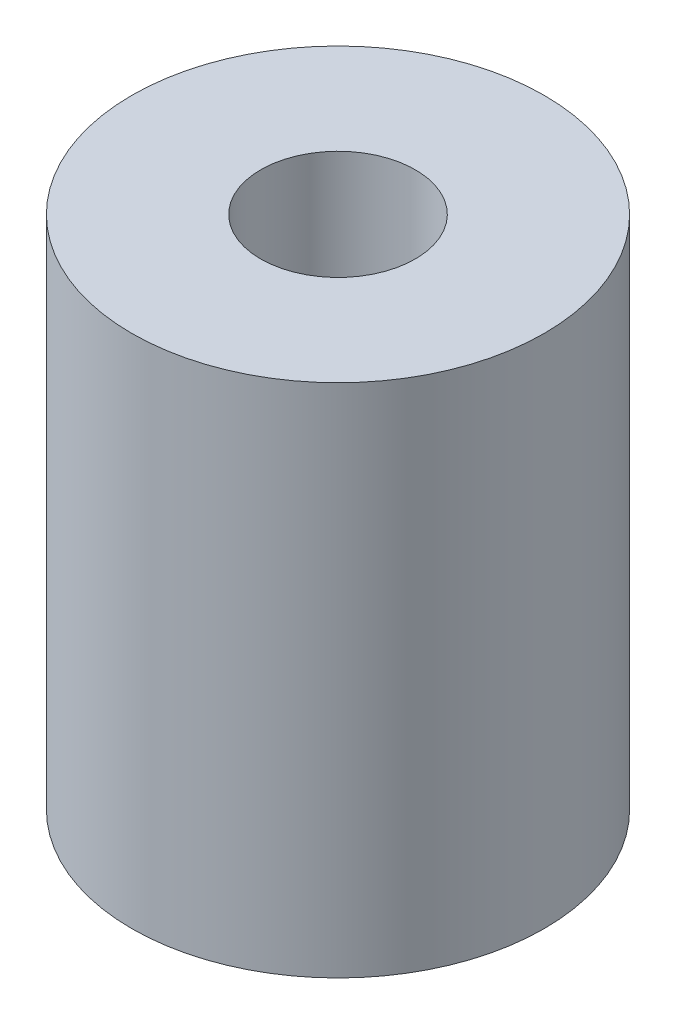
ISO-10303-21;
HEADER;
FILE_DESCRIPTION(('STEP AP214'),'2;1');
FILE_NAME('part.step','',(''),(''),'','','');
FILE_SCHEMA(('AUTOMOTIVE_DESIGN { 1 0 10303 214 1 1 1 1 }'));
ENDSEC;
DATA;
#1=APPLICATION_CONTEXT('core data for automotive mechanical design processes');
#2=APPLICATION_PROTOCOL_DEFINITION('international standard','automotive_design',2000,#1);
#3=PRODUCT_CONTEXT('',#1,'mechanical');
#4=PRODUCT('Part','Part','',(#3));
#5=PRODUCT_RELATED_PRODUCT_CATEGORY('part','',(#4));
#6=PRODUCT_DEFINITION_FORMATION('','',#4);
#7=PRODUCT_DEFINITION_CONTEXT('part definition',#1,'design');
#8=PRODUCT_DEFINITION('design','',#6,#7);
#9=PRODUCT_DEFINITION_SHAPE('','',#8);
#10=(LENGTH_UNIT() NAMED_UNIT(*) SI_UNIT(.MILLI.,.METRE.));
#11=(NAMED_UNIT(*) PLANE_ANGLE_UNIT() SI_UNIT($,.RADIAN.));
#12=(NAMED_UNIT(*) SI_UNIT($,.STERADIAN.) SOLID_ANGLE_UNIT());
#13=UNCERTAINTY_MEASURE_WITH_UNIT(LENGTH_MEASURE(1.E-05),#10,'distance_accuracy_value','');
#14=(GEOMETRIC_REPRESENTATION_CONTEXT(3) GLOBAL_UNCERTAINTY_ASSIGNED_CONTEXT((#13)) GLOBAL_UNIT_ASSIGNED_CONTEXT((#10,
#11,#12)) REPRESENTATION_CONTEXT('',''));
#15=CARTESIAN_POINT('',(0.,0.,0.));
#16=DIRECTION('',(0.,0.,1.));
#17=DIRECTION('',(1.,0.,0.));
#18=AXIS2_PLACEMENT_3D('',#15,#16,#17);
#19=CARTESIAN_POINT('',(0.,0.,0.));
#20=DIRECTION('',(0.,1.,0.));
#21=DIRECTION('',(0.,0.,1.));
#22=AXIS2_PLACEMENT_3D('',#19,#20,#21);
#23=PLANE('',#22);
#24=CARTESIAN_POINT('',(0.,0.,0.));
#25=DIRECTION('',(0.,1.,0.));
#26=DIRECTION('',(0.,0.,1.));
#27=AXIS2_PLACEMENT_3D('',#24,#25,#26);
#28=CIRCLE('',#27,4.);
#29=CARTESIAN_POINT('',(0.,0.,4.));
#30=VERTEX_POINT('',#29);
#31=EDGE_CURVE('E39',#30,#30,#28,.T.);
#32=ORIENTED_EDGE('',*,*,#31,.F.);
#33=EDGE_LOOP('',(#32));
#34=FACE_BOUND('',#33,.T.);
#35=CARTESIAN_POINT('',(0.,0.,0.));
#36=DIRECTION('',(0.,1.,0.));
#37=DIRECTION('',(0.,0.,1.));
#38=AXIS2_PLACEMENT_3D('',#35,#36,#37);
#39=CIRCLE('',#38,2.99999999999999);
#40=CARTESIAN_POINT('',(0.,0.,2.99999999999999));
#41=VERTEX_POINT('',#40);
#42=EDGE_CURVE('E10',#41,#41,#39,.F.);
#43=ORIENTED_EDGE('',*,*,#42,.F.);
#44=EDGE_LOOP('',(#43));
#45=FACE_BOUND('',#44,.T.);
#46=ADVANCED_FACE('F28',(#34,#45),#23,.F.);
#47=CARTESIAN_POINT('',(0.,10.,0.));
#48=DIRECTION('',(0.,-1.,0.));
#49=DIRECTION('',(0.,0.,-1.));
#50=AXIS2_PLACEMENT_3D('',#47,#48,#49);
#51=CYLINDRICAL_SURFACE('',#50,4.);
#52=CARTESIAN_POINT('',(0.,10.,0.));
#53=DIRECTION('',(0.,1.,0.));
#54=DIRECTION('',(0.,0.,1.));
#55=AXIS2_PLACEMENT_3D('',#52,#53,#54);
#56=CIRCLE('',#55,4.);
#57=CARTESIAN_POINT('',(0.,10.,4.));
#58=VERTEX_POINT('',#57);
#59=EDGE_CURVE('E35',#58,#58,#56,.T.);
#60=ORIENTED_EDGE('',*,*,#59,.F.);
#61=EDGE_LOOP('',(#60));
#62=FACE_BOUND('',#61,.T.);
#63=ORIENTED_EDGE('',*,*,#31,.T.);
#64=EDGE_LOOP('',(#63));
#65=FACE_BOUND('',#64,.T.);
#66=ADVANCED_FACE('F30',(#62,#65),#51,.T.);
#67=CARTESIAN_POINT('',(0.,10.,0.));
#68=DIRECTION('',(0.,1.,0.));
#69=DIRECTION('',(0.,0.,1.));
#70=AXIS2_PLACEMENT_3D('',#67,#68,#69);
#71=PLANE('',#70);
#72=CARTESIAN_POINT('',(0.,10.,0.));
#73=DIRECTION('',(0.,1.,0.));
#74=DIRECTION('',(0.,0.,1.));
#75=AXIS2_PLACEMENT_3D('',#72,#73,#74);
#76=CIRCLE('',#75,1.49999999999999);
#77=CARTESIAN_POINT('',(0.,10.,1.49999999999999));
#78=VERTEX_POINT('',#77);
#79=EDGE_CURVE('E57',#78,#78,#76,.T.);
#80=ORIENTED_EDGE('',*,*,#79,.F.);
#81=EDGE_LOOP('',(#80));
#82=FACE_BOUND('',#81,.T.);
#83=ORIENTED_EDGE('',*,*,#59,.T.);
#84=EDGE_LOOP('',(#83));
#85=FACE_BOUND('',#84,.T.);
#86=ADVANCED_FACE('F63',(#82,#85),#71,.T.);
#87=CARTESIAN_POINT('',(0.,-0.5,0.));
#88=DIRECTION('',(0.,1.,0.));
#89=DIRECTION('',(0.,0.,1.));
#90=AXIS2_PLACEMENT_3D('',#87,#88,#89);
#91=CYLINDRICAL_SURFACE('',#90,2.99999999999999);
#92=CARTESIAN_POINT('',(0.,-0.5,0.));
#93=DIRECTION('',(0.,-1.,0.));
#94=DIRECTION('',(0.,0.,-1.));
#95=AXIS2_PLACEMENT_3D('',#92,#93,#94);
#96=CIRCLE('',#95,2.99999999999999);
#97=CARTESIAN_POINT('',(0.,-0.5,-2.99999999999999));
#98=VERTEX_POINT('',#97);
#99=EDGE_CURVE('E44',#98,#98,#96,.T.);
#100=ORIENTED_EDGE('',*,*,#99,.F.);
#101=EDGE_LOOP('',(#100));
#102=FACE_BOUND('',#101,.T.);
#103=ORIENTED_EDGE('',*,*,#42,.T.);
#104=EDGE_LOOP('',(#103));
#105=FACE_BOUND('',#104,.T.);
#106=ADVANCED_FACE('F65',(#102,#105),#91,.T.);
#107=CARTESIAN_POINT('',(0.,-0.5,0.));
#108=DIRECTION('',(0.,-1.,0.));
#109=DIRECTION('',(0.,0.,-1.));
#110=AXIS2_PLACEMENT_3D('',#107,#108,#109);
#111=PLANE('',#110);
#112=CARTESIAN_POINT('',(0.,-0.5,0.));
#113=DIRECTION('',(0.,1.,0.));
#114=DIRECTION('',(0.,0.,1.));
#115=AXIS2_PLACEMENT_3D('',#112,#113,#114);
#116=CIRCLE('',#115,1.25);
#117=CARTESIAN_POINT('',(0.,-0.5,1.25));
#118=VERTEX_POINT('',#117);
#119=EDGE_CURVE('E48',#118,#118,#116,.T.);
#120=ORIENTED_EDGE('',*,*,#119,.T.);
#121=EDGE_LOOP('',(#120));
#122=FACE_BOUND('',#121,.T.);
#123=ORIENTED_EDGE('',*,*,#99,.T.);
#124=EDGE_LOOP('',(#123));
#125=FACE_BOUND('',#124,.T.);
#126=ADVANCED_FACE('F71',(#122,#125),#111,.T.);
#127=CARTESIAN_POINT('',(0.,10.,0.));
#128=DIRECTION('',(0.,1.,0.));
#129=DIRECTION('',(0.,0.,1.));
#130=AXIS2_PLACEMENT_3D('',#127,#128,#129);
#131=CYLINDRICAL_SURFACE('',#130,1.25);
#132=ORIENTED_EDGE('',*,*,#119,.F.);
#133=EDGE_LOOP('',(#132));
#134=FACE_BOUND('',#133,.T.);
#135=CARTESIAN_POINT('',(0.,4.,0.));
#136=DIRECTION('',(0.,1.,0.));
#137=DIRECTION('',(0.,0.,1.));
#138=AXIS2_PLACEMENT_3D('',#135,#136,#137);
#139=CIRCLE('',#138,1.25);
#140=CARTESIAN_POINT('',(0.,4.,1.25));
#141=VERTEX_POINT('',#140);
#142=EDGE_CURVE('E51',#141,#141,#139,.T.);
#143=ORIENTED_EDGE('',*,*,#142,.T.);
#144=EDGE_LOOP('',(#143));
#145=FACE_BOUND('',#144,.T.);
#146=ADVANCED_FACE('F107',(#134,#145),#131,.F.);
#147=CARTESIAN_POINT('',(1.25,4.,0.));
#148=DIRECTION('',(0.,-1.,0.));
#149=DIRECTION('',(0.,0.,-1.));
#150=AXIS2_PLACEMENT_3D('',#147,#148,#149);
#151=PLANE('',#150);
#152=ORIENTED_EDGE('',*,*,#142,.F.);
#153=EDGE_LOOP('',(#152));
#154=FACE_BOUND('',#153,.T.);
#155=CARTESIAN_POINT('',(0.,4.,0.));
#156=DIRECTION('',(0.,1.,0.));
#157=DIRECTION('',(0.,0.,1.));
#158=AXIS2_PLACEMENT_3D('',#155,#156,#157);
#159=CIRCLE('',#158,1.5);
#160=CARTESIAN_POINT('',(0.,4.,1.5));
#161=VERTEX_POINT('',#160);
#162=EDGE_CURVE('E54',#161,#161,#159,.T.);
#163=ORIENTED_EDGE('',*,*,#162,.T.);
#164=EDGE_LOOP('',(#163));
#165=FACE_BOUND('',#164,.T.);
#166=ADVANCED_FACE('F116',(#154,#165),#151,.F.);
#167=CARTESIAN_POINT('',(0.,10.,0.));
#168=DIRECTION('',(0.,1.,0.));
#169=DIRECTION('',(0.,0.,1.));
#170=AXIS2_PLACEMENT_3D('',#167,#168,#169);
#171=CYLINDRICAL_SURFACE('',#170,1.5);
#172=ORIENTED_EDGE('',*,*,#162,.F.);
#173=EDGE_LOOP('',(#172));
#174=FACE_BOUND('',#173,.T.);
#175=ORIENTED_EDGE('',*,*,#79,.T.);
#176=EDGE_LOOP('',(#175));
#177=FACE_BOUND('',#176,.T.);
#178=ADVANCED_FACE('F61',(#174,#177),#171,.F.);
#179=CLOSED_SHELL('',(#46,#66,#86,#106,#126,#146,#166,#178));
#180=MANIFOLD_SOLID_BREP('B2',#179);
#181=ADVANCED_BREP_SHAPE_REPRESENTATION('',(#18,#180),#14);
#182=SHAPE_DEFINITION_REPRESENTATION(#9,#181);
ENDSEC;
END-ISO-10303-21;
